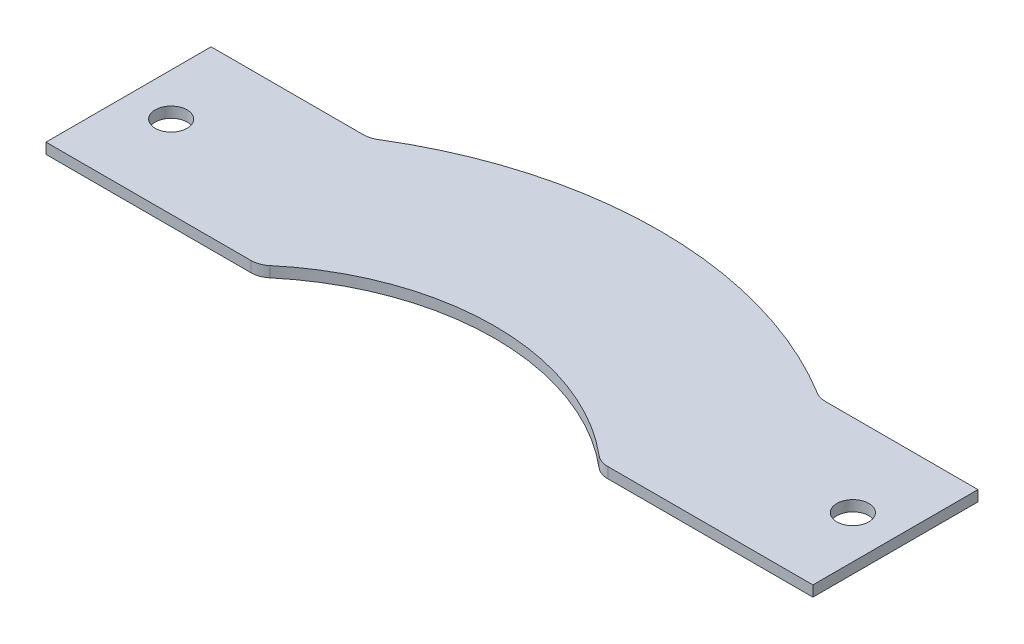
from build123d import *

# Parameters (mm, degrees)
SKETCH1_R      = 4.7625
EXTRUDE1_DEPTH = 3.175


with BuildPart() as part:
    # Sketch1 → Extrude1 (new body)
    with BuildSketch(Plane(origin=(0, 0, 0), x_dir=(1, 0, 0), z_dir=(0, 1, 0))):
        with BuildLine():
            Line((-53.17019082, 56.796126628), (-114.3, 56.796126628))
            Line((-114.3, 56.796126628), (-114.3, 106.008626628))
            Line((-114.3, 106.008626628), (-68.825107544, 106.008626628))
            ThreePointArc((-68.825107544, 106.008626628), (-67.102021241, 106.246877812), (-65.508234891, 106.943753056))
            ThreePointArc((-65.508234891, 106.943753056), (0, 125.4125), (65.508234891, 106.943753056))
            ThreePointArc((65.508234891, 106.943753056), (67.102021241, 106.246877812), (68.825107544, 106.008626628))
            Line((68.825107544, 106.008626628), (114.3, 106.008626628))
            Line((114.3, 106.008626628), (114.3, 56.796126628))
            Line((114.3, 56.796126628), (53.17019082, 56.796126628))
            ThreePointArc((53.17019082, 56.796126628), (50.99326112, 57.180937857), (49.080176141, 58.288732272))
            ThreePointArc((49.080176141, 58.288732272), (0, 76.2), (-49.080176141, 58.288732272))
            ThreePointArc((-49.080176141, 58.288732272), (-50.99326112, 57.180937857), (-53.17019082, 56.796126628))
        make_face()
        with Locations(Location((101.6, 81.402376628, 0), (0, 0, 270))):
            Circle(SKETCH1_R, mode=Mode.SUBTRACT)
        with Locations(Location((-101.6, 81.402376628, 0), (0, 0, 270))):
            Circle(SKETCH1_R, mode=Mode.SUBTRACT)
    extrude(amount=EXTRUDE1_DEPTH)


solid = part.part
